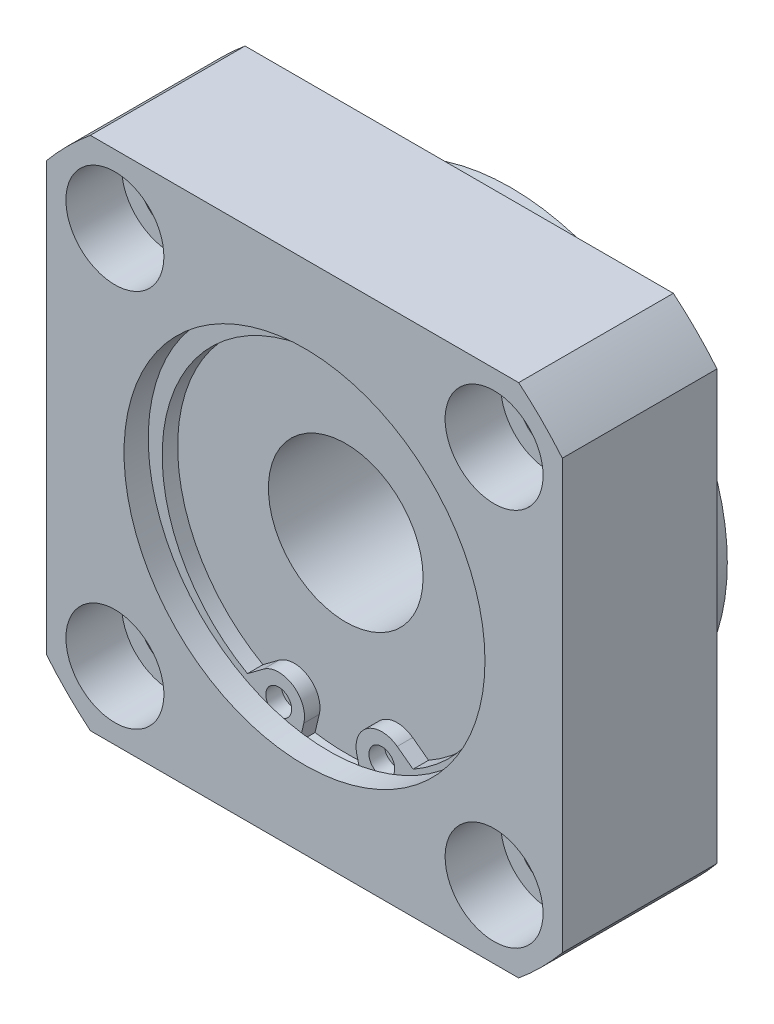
ISO-10303-21;
HEADER;
FILE_DESCRIPTION(('STEP AP214'),'2;1');
FILE_NAME('part.step','',(''),(''),'','','');
FILE_SCHEMA(('AUTOMOTIVE_DESIGN { 1 0 10303 214 1 1 1 1 }'));
ENDSEC;
DATA;
#1=APPLICATION_CONTEXT('core data for automotive mechanical design processes');
#2=APPLICATION_PROTOCOL_DEFINITION('international standard','automotive_design',2000,#1);
#3=PRODUCT_CONTEXT('',#1,'mechanical');
#4=PRODUCT('Part','Part','',(#3));
#5=PRODUCT_RELATED_PRODUCT_CATEGORY('part','',(#4));
#6=PRODUCT_DEFINITION_FORMATION('','',#4);
#7=PRODUCT_DEFINITION_CONTEXT('part definition',#1,'design');
#8=PRODUCT_DEFINITION('design','',#6,#7);
#9=PRODUCT_DEFINITION_SHAPE('','',#8);
#10=(LENGTH_UNIT() NAMED_UNIT(*) SI_UNIT(.MILLI.,.METRE.));
#11=(NAMED_UNIT(*) PLANE_ANGLE_UNIT() SI_UNIT($,.RADIAN.));
#12=(NAMED_UNIT(*) SI_UNIT($,.STERADIAN.) SOLID_ANGLE_UNIT());
#13=UNCERTAINTY_MEASURE_WITH_UNIT(LENGTH_MEASURE(1.E-05),#10,'distance_accuracy_value','');
#14=(GEOMETRIC_REPRESENTATION_CONTEXT(3) GLOBAL_UNCERTAINTY_ASSIGNED_CONTEXT((#13)) GLOBAL_UNIT_ASSIGNED_CONTEXT((#10,
#11,#12)) REPRESENTATION_CONTEXT('',''));
#15=CARTESIAN_POINT('',(0.,0.,0.));
#16=DIRECTION('',(0.,0.,1.));
#17=DIRECTION('',(1.,0.,0.));
#18=AXIS2_PLACEMENT_3D('',#15,#16,#17);
#19=CARTESIAN_POINT('',(18.3847763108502,18.3847763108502,0.));
#20=DIRECTION('',(0.,0.,1.));
#21=DIRECTION('',(1.,0.,0.));
#22=AXIS2_PLACEMENT_3D('',#19,#20,#21);
#23=CYLINDRICAL_SURFACE('',#22,3.);
#24=CARTESIAN_POINT('',(18.3847763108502,18.3847763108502,0.));
#25=DIRECTION('',(0.,0.,1.));
#26=DIRECTION('',(1.,0.,0.));
#27=AXIS2_PLACEMENT_3D('',#24,#25,#26);
#28=CIRCLE('',#27,3.);
#29=CARTESIAN_POINT('',(21.3847763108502,18.3847763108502,0.));
#30=VERTEX_POINT('',#29);
#31=EDGE_CURVE('E268',#30,#30,#28,.T.);
#32=ORIENTED_EDGE('',*,*,#31,.F.);
#33=EDGE_LOOP('',(#32));
#34=FACE_BOUND('',#33,.T.);
#35=CARTESIAN_POINT('',(18.3847763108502,18.3847763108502,9.6));
#36=DIRECTION('',(0.,0.,1.));
#37=DIRECTION('',(1.,0.,0.));
#38=AXIS2_PLACEMENT_3D('',#35,#36,#37);
#39=CIRCLE('',#38,3.);
#40=CARTESIAN_POINT('',(21.3847763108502,18.3847763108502,9.6));
#41=VERTEX_POINT('',#40);
#42=EDGE_CURVE('E265',#41,#41,#39,.F.);
#43=ORIENTED_EDGE('',*,*,#42,.F.);
#44=EDGE_LOOP('',(#43));
#45=FACE_BOUND('',#44,.T.);
#46=ADVANCED_FACE('F14',(#34,#45),#23,.F.);
#47=CARTESIAN_POINT('',(18.3847763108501,-18.3847763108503,0.));
#48=DIRECTION('',(0.,0.,1.));
#49=DIRECTION('',(1.,0.,0.));
#50=AXIS2_PLACEMENT_3D('',#47,#48,#49);
#51=CYLINDRICAL_SURFACE('',#50,3.);
#52=CARTESIAN_POINT('',(18.3847763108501,-18.3847763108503,0.));
#53=DIRECTION('',(0.,0.,1.));
#54=DIRECTION('',(0.,-1.,0.));
#55=AXIS2_PLACEMENT_3D('',#52,#53,#54);
#56=CIRCLE('',#55,3.);
#57=CARTESIAN_POINT('',(18.3847763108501,-21.3847763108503,0.));
#58=VERTEX_POINT('',#57);
#59=EDGE_CURVE('E341',#58,#58,#56,.T.);
#60=ORIENTED_EDGE('',*,*,#59,.F.);
#61=EDGE_LOOP('',(#60));
#62=FACE_BOUND('',#61,.T.);
#63=CARTESIAN_POINT('',(18.3847763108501,-18.3847763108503,9.6));
#64=DIRECTION('',(0.,0.,1.));
#65=DIRECTION('',(1.,0.,0.));
#66=AXIS2_PLACEMENT_3D('',#63,#64,#65);
#67=CIRCLE('',#66,3.);
#68=CARTESIAN_POINT('',(21.3847763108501,-18.3847763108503,9.6));
#69=VERTEX_POINT('',#68);
#70=EDGE_CURVE('E260',#69,#69,#67,.F.);
#71=ORIENTED_EDGE('',*,*,#70,.F.);
#72=EDGE_LOOP('',(#71));
#73=FACE_BOUND('',#72,.T.);
#74=ADVANCED_FACE('F535',(#62,#73),#51,.F.);
#75=CARTESIAN_POINT('',(-18.3847763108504,-18.3847763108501,0.));
#76=DIRECTION('',(0.,0.,1.));
#77=DIRECTION('',(1.,0.,0.));
#78=AXIS2_PLACEMENT_3D('',#75,#76,#77);
#79=CYLINDRICAL_SURFACE('',#78,3.);
#80=CARTESIAN_POINT('',(-18.3847763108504,-18.3847763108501,0.));
#81=DIRECTION('',(0.,0.,1.));
#82=DIRECTION('',(-1.,0.,0.));
#83=AXIS2_PLACEMENT_3D('',#80,#81,#82);
#84=CIRCLE('',#83,3.);
#85=CARTESIAN_POINT('',(-21.3847763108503,-18.3847763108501,0.));
#86=VERTEX_POINT('',#85);
#87=EDGE_CURVE('E344',#86,#86,#84,.T.);
#88=ORIENTED_EDGE('',*,*,#87,.F.);
#89=EDGE_LOOP('',(#88));
#90=FACE_BOUND('',#89,.T.);
#91=CARTESIAN_POINT('',(-18.3847763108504,-18.3847763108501,9.6));
#92=DIRECTION('',(0.,0.,1.));
#93=DIRECTION('',(1.,0.,0.));
#94=AXIS2_PLACEMENT_3D('',#91,#92,#93);
#95=CIRCLE('',#94,3.);
#96=CARTESIAN_POINT('',(-15.3847763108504,-18.3847763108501,9.6));
#97=VERTEX_POINT('',#96);
#98=EDGE_CURVE('E255',#97,#97,#95,.F.);
#99=ORIENTED_EDGE('',*,*,#98,.F.);
#100=EDGE_LOOP('',(#99));
#101=FACE_BOUND('',#100,.T.);
#102=ADVANCED_FACE('F544',(#90,#101),#79,.F.);
#103=CARTESIAN_POINT('',(-18.3847763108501,18.3847763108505,0.));
#104=DIRECTION('',(0.,0.,1.));
#105=DIRECTION('',(1.,0.,0.));
#106=AXIS2_PLACEMENT_3D('',#103,#104,#105);
#107=CYLINDRICAL_SURFACE('',#106,3.);
#108=CARTESIAN_POINT('',(-18.3847763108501,18.3847763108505,0.));
#109=DIRECTION('',(0.,0.,1.));
#110=DIRECTION('',(0.,1.,0.));
#111=AXIS2_PLACEMENT_3D('',#108,#109,#110);
#112=CIRCLE('',#111,3.);
#113=CARTESIAN_POINT('',(-18.38477631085,21.3847763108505,0.));
#114=VERTEX_POINT('',#113);
#115=EDGE_CURVE('E263',#114,#114,#112,.T.);
#116=ORIENTED_EDGE('',*,*,#115,.F.);
#117=EDGE_LOOP('',(#116));
#118=FACE_BOUND('',#117,.T.);
#119=CARTESIAN_POINT('',(-18.3847763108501,18.3847763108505,9.6));
#120=DIRECTION('',(0.,0.,1.));
#121=DIRECTION('',(1.,0.,0.));
#122=AXIS2_PLACEMENT_3D('',#119,#120,#121);
#123=CIRCLE('',#122,3.);
#124=CARTESIAN_POINT('',(-15.3847763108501,18.3847763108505,9.6));
#125=VERTEX_POINT('',#124);
#126=EDGE_CURVE('E250',#125,#125,#123,.F.);
#127=ORIENTED_EDGE('',*,*,#126,.F.);
#128=EDGE_LOOP('',(#127));
#129=FACE_BOUND('',#128,.T.);
#130=ADVANCED_FACE('F553',(#118,#129),#107,.F.);
#131=CARTESIAN_POINT('',(0.,0.,-5.));
#132=DIRECTION('',(0.,0.,1.));
#133=DIRECTION('',(1.,0.,0.));
#134=AXIS2_PLACEMENT_3D('',#131,#132,#133);
#135=CYLINDRICAL_SURFACE('',#134,21.);
#136=CARTESIAN_POINT('',(0.,0.,-5.));
#137=DIRECTION('',(0.,0.,-1.));
#138=DIRECTION('',(-1.,0.,0.));
#139=AXIS2_PLACEMENT_3D('',#136,#137,#138);
#140=CIRCLE('',#139,21.);
#141=CARTESIAN_POINT('',(-21.,0.,-5.));
#142=VERTEX_POINT('',#141);
#143=EDGE_CURVE('E363',#142,#142,#140,.T.);
#144=ORIENTED_EDGE('',*,*,#143,.F.);
#145=EDGE_LOOP('',(#144));
#146=FACE_BOUND('',#145,.T.);
#147=CARTESIAN_POINT('',(0.,0.,0.));
#148=DIRECTION('',(0.,0.,-1.));
#149=DIRECTION('',(-1.,0.,0.));
#150=AXIS2_PLACEMENT_3D('',#147,#148,#149);
#151=CIRCLE('',#150,21.);
#152=CARTESIAN_POINT('',(-21.,0.,0.));
#153=VERTEX_POINT('',#152);
#154=EDGE_CURVE('E239',#153,#153,#151,.T.);
#155=ORIENTED_EDGE('',*,*,#154,.T.);
#156=EDGE_LOOP('',(#155));
#157=FACE_BOUND('',#156,.T.);
#158=ADVANCED_FACE('F562',(#146,#157),#135,.T.);
#159=CARTESIAN_POINT('',(0.,0.,0.));
#160=DIRECTION('',(0.,0.,-1.));
#161=DIRECTION('',(-1.,0.,0.));
#162=AXIS2_PLACEMENT_3D('',#159,#160,#161);
#163=PLANE('',#162);
#164=ORIENTED_EDGE('',*,*,#154,.F.);
#165=EDGE_LOOP('',(#164));
#166=FACE_BOUND('',#165,.T.);
#167=ORIENTED_EDGE('',*,*,#115,.T.);
#168=EDGE_LOOP('',(#167));
#169=FACE_BOUND('',#168,.T.);
#170=ORIENTED_EDGE('',*,*,#87,.T.);
#171=EDGE_LOOP('',(#170));
#172=FACE_BOUND('',#171,.T.);
#173=ORIENTED_EDGE('',*,*,#59,.T.);
#174=EDGE_LOOP('',(#173));
#175=FACE_BOUND('',#174,.T.);
#176=ORIENTED_EDGE('',*,*,#31,.T.);
#177=EDGE_LOOP('',(#176));
#178=FACE_BOUND('',#177,.T.);
#179=CARTESIAN_POINT('',(0.,0.,0.));
#180=DIRECTION('',(0.,0.,-1.));
#181=DIRECTION('',(-1.,0.,0.));
#182=AXIS2_PLACEMENT_3D('',#179,#180,#181);
#183=CIRCLE('',#182,32.5);
#184=CARTESIAN_POINT('',(25.,-20.7665596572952,0.));
#185=VERTEX_POINT('',#184);
#186=CARTESIAN_POINT('',(20.7665596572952,-25.,0.));
#187=VERTEX_POINT('',#186);
#188=EDGE_CURVE('E329',#185,#187,#183,.T.);
#189=ORIENTED_EDGE('',*,*,#188,.T.);
#190=DIRECTION('',(1.,0.,0.));
#191=VECTOR('',#190,1.);
#192=CARTESIAN_POINT('',(-20.7665596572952,-25.,0.));
#193=LINE('',#192,#191);
#194=CARTESIAN_POINT('',(-20.7665596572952,-25.,0.));
#195=VERTEX_POINT('',#194);
#196=EDGE_CURVE('E326',#195,#187,#193,.T.);
#197=ORIENTED_EDGE('',*,*,#196,.F.);
#198=CARTESIAN_POINT('',(0.,0.,0.));
#199=DIRECTION('',(0.,0.,1.));
#200=DIRECTION('',(1.,0.,0.));
#201=AXIS2_PLACEMENT_3D('',#198,#199,#200);
#202=CIRCLE('',#201,32.5);
#203=CARTESIAN_POINT('',(-25.,-20.7665596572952,0.));
#204=VERTEX_POINT('',#203);
#205=EDGE_CURVE('E323',#204,#195,#202,.T.);
#206=ORIENTED_EDGE('',*,*,#205,.F.);
#207=DIRECTION('',(0.,-1.,0.));
#208=VECTOR('',#207,1.);
#209=CARTESIAN_POINT('',(-25.,20.7665596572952,0.));
#210=LINE('',#209,#208);
#211=CARTESIAN_POINT('',(-25.,20.7665596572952,0.));
#212=VERTEX_POINT('',#211);
#213=EDGE_CURVE('E320',#212,#204,#210,.T.);
#214=ORIENTED_EDGE('',*,*,#213,.F.);
#215=CARTESIAN_POINT('',(0.,0.,0.));
#216=DIRECTION('',(0.,0.,-1.));
#217=DIRECTION('',(-1.,0.,0.));
#218=AXIS2_PLACEMENT_3D('',#215,#216,#217);
#219=CIRCLE('',#218,32.5);
#220=CARTESIAN_POINT('',(-20.7665596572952,25.,0.));
#221=VERTEX_POINT('',#220);
#222=EDGE_CURVE('E317',#212,#221,#219,.T.);
#223=ORIENTED_EDGE('',*,*,#222,.T.);
#224=DIRECTION('',(1.,0.,0.));
#225=VECTOR('',#224,1.);
#226=CARTESIAN_POINT('',(-20.7665596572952,25.,0.));
#227=LINE('',#226,#225);
#228=CARTESIAN_POINT('',(20.7665596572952,25.,0.));
#229=VERTEX_POINT('',#228);
#230=EDGE_CURVE('E314',#221,#229,#227,.T.);
#231=ORIENTED_EDGE('',*,*,#230,.T.);
#232=CARTESIAN_POINT('',(0.,0.,0.));
#233=DIRECTION('',(0.,0.,1.));
#234=DIRECTION('',(1.,0.,0.));
#235=AXIS2_PLACEMENT_3D('',#232,#233,#234);
#236=CIRCLE('',#235,32.5);
#237=CARTESIAN_POINT('',(25.,20.7665596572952,0.));
#238=VERTEX_POINT('',#237);
#239=EDGE_CURVE('E311',#238,#229,#236,.T.);
#240=ORIENTED_EDGE('',*,*,#239,.F.);
#241=DIRECTION('',(0.,-1.,0.));
#242=VECTOR('',#241,1.);
#243=CARTESIAN_POINT('',(25.,20.7665596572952,0.));
#244=LINE('',#243,#242);
#245=EDGE_CURVE('E308',#238,#185,#244,.T.);
#246=ORIENTED_EDGE('',*,*,#245,.T.);
#247=EDGE_LOOP('',(#189,#197,#206,#214,#223,#231,#240,#246));
#248=FACE_BOUND('',#247,.T.);
#249=ADVANCED_FACE('F437',(#166,#169,#172,#175,#178,#248),#163,.T.);
#250=CARTESIAN_POINT('',(18.3847763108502,18.3847763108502,9.6));
#251=DIRECTION('',(0.,0.,1.));
#252=DIRECTION('',(1.,0.,0.));
#253=AXIS2_PLACEMENT_3D('',#250,#251,#252);
#254=PLANE('',#253);
#255=CARTESIAN_POINT('',(18.3847763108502,18.3847763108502,9.6));
#256=DIRECTION('',(0.,0.,1.));
#257=DIRECTION('',(1.,0.,0.));
#258=AXIS2_PLACEMENT_3D('',#255,#256,#257);
#259=CIRCLE('',#258,4.75);
#260=CARTESIAN_POINT('',(23.1347763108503,18.3847763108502,9.6));
#261=VERTEX_POINT('',#260);
#262=EDGE_CURVE('E269',#261,#261,#259,.T.);
#263=ORIENTED_EDGE('',*,*,#262,.T.);
#264=EDGE_LOOP('',(#263));
#265=FACE_BOUND('',#264,.T.);
#266=ORIENTED_EDGE('',*,*,#42,.T.);
#267=EDGE_LOOP('',(#266));
#268=FACE_BOUND('',#267,.T.);
#269=ADVANCED_FACE('F579',(#265,#268),#254,.T.);
#270=CARTESIAN_POINT('',(18.3847763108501,-18.3847763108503,9.6));
#271=DIRECTION('',(0.,0.,1.));
#272=DIRECTION('',(0.,-1.,0.));
#273=AXIS2_PLACEMENT_3D('',#270,#271,#272);
#274=PLANE('',#273);
#275=CARTESIAN_POINT('',(18.3847763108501,-18.3847763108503,9.6));
#276=DIRECTION('',(0.,0.,1.));
#277=DIRECTION('',(0.,-1.,0.));
#278=AXIS2_PLACEMENT_3D('',#275,#276,#277);
#279=CIRCLE('',#278,4.75);
#280=CARTESIAN_POINT('',(18.3847763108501,-23.1347763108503,9.6));
#281=VERTEX_POINT('',#280);
#282=EDGE_CURVE('E264',#281,#281,#279,.T.);
#283=ORIENTED_EDGE('',*,*,#282,.T.);
#284=EDGE_LOOP('',(#283));
#285=FACE_BOUND('',#284,.T.);
#286=ORIENTED_EDGE('',*,*,#70,.T.);
#287=EDGE_LOOP('',(#286));
#288=FACE_BOUND('',#287,.T.);
#289=ADVANCED_FACE('F588',(#285,#288),#274,.T.);
#290=CARTESIAN_POINT('',(-18.3847763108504,-18.3847763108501,9.6));
#291=DIRECTION('',(0.,0.,1.));
#292=DIRECTION('',(-1.,0.,0.));
#293=AXIS2_PLACEMENT_3D('',#290,#291,#292);
#294=PLANE('',#293);
#295=CARTESIAN_POINT('',(-18.3847763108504,-18.3847763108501,9.6));
#296=DIRECTION('',(0.,0.,1.));
#297=DIRECTION('',(-1.,0.,0.));
#298=AXIS2_PLACEMENT_3D('',#295,#296,#297);
#299=CIRCLE('',#298,4.75);
#300=CARTESIAN_POINT('',(-23.1347763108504,-18.3847763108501,9.6));
#301=VERTEX_POINT('',#300);
#302=EDGE_CURVE('E259',#301,#301,#299,.T.);
#303=ORIENTED_EDGE('',*,*,#302,.T.);
#304=EDGE_LOOP('',(#303));
#305=FACE_BOUND('',#304,.T.);
#306=ORIENTED_EDGE('',*,*,#98,.T.);
#307=EDGE_LOOP('',(#306));
#308=FACE_BOUND('',#307,.T.);
#309=ADVANCED_FACE('F597',(#305,#308),#294,.T.);
#310=CARTESIAN_POINT('',(-18.3847763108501,18.3847763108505,9.6));
#311=DIRECTION('',(0.,0.,1.));
#312=DIRECTION('',(0.,1.,0.));
#313=AXIS2_PLACEMENT_3D('',#310,#311,#312);
#314=PLANE('',#313);
#315=CARTESIAN_POINT('',(-18.3847763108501,18.3847763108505,9.6));
#316=DIRECTION('',(0.,0.,1.));
#317=DIRECTION('',(0.,1.,0.));
#318=AXIS2_PLACEMENT_3D('',#315,#316,#317);
#319=CIRCLE('',#318,4.75);
#320=CARTESIAN_POINT('',(-18.38477631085,23.1347763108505,9.6));
#321=VERTEX_POINT('',#320);
#322=EDGE_CURVE('E254',#321,#321,#319,.T.);
#323=ORIENTED_EDGE('',*,*,#322,.T.);
#324=EDGE_LOOP('',(#323));
#325=FACE_BOUND('',#324,.T.);
#326=ORIENTED_EDGE('',*,*,#126,.T.);
#327=EDGE_LOOP('',(#326));
#328=FACE_BOUND('',#327,.T.);
#329=ADVANCED_FACE('F606',(#325,#328),#314,.T.);
#330=CARTESIAN_POINT('',(0.,0.,-5.));
#331=DIRECTION('',(0.,0.,-1.));
#332=DIRECTION('',(-1.,0.,0.));
#333=AXIS2_PLACEMENT_3D('',#330,#331,#332);
#334=PLANE('',#333);
#335=ORIENTED_EDGE('',*,*,#143,.T.);
#336=EDGE_LOOP('',(#335));
#337=FACE_BOUND('',#336,.T.);
#338=CARTESIAN_POINT('',(0.,0.,-5.));
#339=DIRECTION('',(0.,0.,-1.));
#340=DIRECTION('',(-1.,0.,0.));
#341=AXIS2_PLACEMENT_3D('',#338,#339,#340);
#342=CIRCLE('',#341,14.5);
#343=CARTESIAN_POINT('',(-14.5,0.,-5.));
#344=VERTEX_POINT('',#343);
#345=EDGE_CURVE('E366',#344,#344,#342,.T.);
#346=ORIENTED_EDGE('',*,*,#345,.F.);
#347=EDGE_LOOP('',(#346));
#348=FACE_BOUND('',#347,.T.);
#349=ADVANCED_FACE('F615',(#337,#348),#334,.T.);
#350=CARTESIAN_POINT('',(-20.7665596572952,-25.,15.));
#351=DIRECTION('',(0.,1.,0.));
#352=DIRECTION('',(0.,0.,1.));
#353=AXIS2_PLACEMENT_3D('',#350,#351,#352);
#354=PLANE('',#353);
#355=DIRECTION('',(1.,0.,0.));
#356=VECTOR('',#355,1.);
#357=CARTESIAN_POINT('',(-20.7665596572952,-25.,15.));
#358=LINE('',#357,#356);
#359=CARTESIAN_POINT('',(-20.7665596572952,-25.,15.));
#360=VERTEX_POINT('',#359);
#361=CARTESIAN_POINT('',(20.7665596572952,-25.,15.));
#362=VERTEX_POINT('',#361);
#363=EDGE_CURVE('E303',#360,#362,#358,.T.);
#364=ORIENTED_EDGE('',*,*,#363,.F.);
#365=DIRECTION('',(0.,0.,-1.));
#366=VECTOR('',#365,1.);
#367=CARTESIAN_POINT('',(-20.7665596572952,-25.,15.));
#368=LINE('',#367,#366);
#369=EDGE_CURVE('E282',#360,#195,#368,.T.);
#370=ORIENTED_EDGE('',*,*,#369,.T.);
#371=ORIENTED_EDGE('',*,*,#196,.T.);
#372=DIRECTION('',(0.,0.,-1.));
#373=VECTOR('',#372,1.);
#374=CARTESIAN_POINT('',(20.7665596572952,-25.,15.));
#375=LINE('',#374,#373);
#376=EDGE_CURVE('E74',#362,#187,#375,.T.);
#377=ORIENTED_EDGE('',*,*,#376,.F.);
#378=EDGE_LOOP('',(#364,#370,#371,#377));
#379=FACE_BOUND('',#378,.T.);
#380=ADVANCED_FACE('F435',(#379),#354,.F.);
#381=CARTESIAN_POINT('',(0.,0.,15.));
#382=DIRECTION('',(0.,0.,-1.));
#383=DIRECTION('',(-1.,0.,0.));
#384=AXIS2_PLACEMENT_3D('',#381,#382,#383);
#385=CYLINDRICAL_SURFACE('',#384,32.5);
#386=ORIENTED_EDGE('',*,*,#369,.F.);
#387=CARTESIAN_POINT('',(0.,0.,15.));
#388=DIRECTION('',(0.,0.,1.));
#389=DIRECTION('',(1.,0.,0.));
#390=AXIS2_PLACEMENT_3D('',#387,#388,#389);
#391=CIRCLE('',#390,32.5);
#392=CARTESIAN_POINT('',(-25.,-20.7665596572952,15.));
#393=VERTEX_POINT('',#392);
#394=EDGE_CURVE('E300',#393,#360,#391,.T.);
#395=ORIENTED_EDGE('',*,*,#394,.F.);
#396=DIRECTION('',(0.,0.,-1.));
#397=VECTOR('',#396,1.);
#398=CARTESIAN_POINT('',(-25.,-20.7665596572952,15.));
#399=LINE('',#398,#397);
#400=EDGE_CURVE('E280',#393,#204,#399,.T.);
#401=ORIENTED_EDGE('',*,*,#400,.T.);
#402=ORIENTED_EDGE('',*,*,#205,.T.);
#403=EDGE_LOOP('',(#386,#395,#401,#402));
#404=FACE_BOUND('',#403,.T.);
#405=ADVANCED_FACE('F431',(#404),#385,.T.);
#406=CARTESIAN_POINT('',(-25.,20.7665596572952,15.));
#407=DIRECTION('',(1.,0.,0.));
#408=DIRECTION('',(0.,0.,-1.));
#409=AXIS2_PLACEMENT_3D('',#406,#407,#408);
#410=PLANE('',#409);
#411=ORIENTED_EDGE('',*,*,#400,.F.);
#412=DIRECTION('',(0.,-1.,0.));
#413=VECTOR('',#412,1.);
#414=CARTESIAN_POINT('',(-25.,20.7665596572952,15.));
#415=LINE('',#414,#413);
#416=CARTESIAN_POINT('',(-25.,20.7665596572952,15.));
#417=VERTEX_POINT('',#416);
#418=EDGE_CURVE('E297',#417,#393,#415,.T.);
#419=ORIENTED_EDGE('',*,*,#418,.F.);
#420=DIRECTION('',(0.,0.,-1.));
#421=VECTOR('',#420,1.);
#422=CARTESIAN_POINT('',(-25.,20.7665596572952,15.));
#423=LINE('',#422,#421);
#424=EDGE_CURVE('E278',#417,#212,#423,.T.);
#425=ORIENTED_EDGE('',*,*,#424,.T.);
#426=ORIENTED_EDGE('',*,*,#213,.T.);
#427=EDGE_LOOP('',(#411,#419,#425,#426));
#428=FACE_BOUND('',#427,.T.);
#429=ADVANCED_FACE('F428',(#428),#410,.F.);
#430=CARTESIAN_POINT('',(0.,0.,15.));
#431=DIRECTION('',(0.,0.,-1.));
#432=DIRECTION('',(-1.,0.,0.));
#433=AXIS2_PLACEMENT_3D('',#430,#431,#432);
#434=CYLINDRICAL_SURFACE('',#433,32.5);
#435=ORIENTED_EDGE('',*,*,#424,.F.);
#436=CARTESIAN_POINT('',(0.,0.,15.));
#437=DIRECTION('',(0.,0.,-1.));
#438=DIRECTION('',(-1.,0.,0.));
#439=AXIS2_PLACEMENT_3D('',#436,#437,#438);
#440=CIRCLE('',#439,32.5);
#441=CARTESIAN_POINT('',(-20.7665596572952,25.,15.));
#442=VERTEX_POINT('',#441);
#443=EDGE_CURVE('E294',#417,#442,#440,.T.);
#444=ORIENTED_EDGE('',*,*,#443,.T.);
#445=DIRECTION('',(0.,0.,-1.));
#446=VECTOR('',#445,1.);
#447=CARTESIAN_POINT('',(-20.7665596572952,25.,15.));
#448=LINE('',#447,#446);
#449=EDGE_CURVE('E276',#442,#221,#448,.T.);
#450=ORIENTED_EDGE('',*,*,#449,.T.);
#451=ORIENTED_EDGE('',*,*,#222,.F.);
#452=EDGE_LOOP('',(#435,#444,#450,#451));
#453=FACE_BOUND('',#452,.T.);
#454=ADVANCED_FACE('F424',(#453),#434,.T.);
#455=CARTESIAN_POINT('',(-20.7665596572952,25.,15.));
#456=DIRECTION('',(0.,1.,0.));
#457=DIRECTION('',(0.,0.,1.));
#458=AXIS2_PLACEMENT_3D('',#455,#456,#457);
#459=PLANE('',#458);
#460=ORIENTED_EDGE('',*,*,#449,.F.);
#461=DIRECTION('',(1.,0.,0.));
#462=VECTOR('',#461,1.);
#463=CARTESIAN_POINT('',(-20.7665596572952,25.,15.));
#464=LINE('',#463,#462);
#465=CARTESIAN_POINT('',(20.7665596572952,25.,15.));
#466=VERTEX_POINT('',#465);
#467=EDGE_CURVE('E291',#442,#466,#464,.T.);
#468=ORIENTED_EDGE('',*,*,#467,.T.);
#469=DIRECTION('',(0.,0.,-1.));
#470=VECTOR('',#469,1.);
#471=CARTESIAN_POINT('',(20.7665596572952,25.,15.));
#472=LINE('',#471,#470);
#473=EDGE_CURVE('E274',#466,#229,#472,.T.);
#474=ORIENTED_EDGE('',*,*,#473,.T.);
#475=ORIENTED_EDGE('',*,*,#230,.F.);
#476=EDGE_LOOP('',(#460,#468,#474,#475));
#477=FACE_BOUND('',#476,.T.);
#478=ADVANCED_FACE('F420',(#477),#459,.T.);
#479=CARTESIAN_POINT('',(0.,0.,15.));
#480=DIRECTION('',(0.,0.,-1.));
#481=DIRECTION('',(-1.,0.,0.));
#482=AXIS2_PLACEMENT_3D('',#479,#480,#481);
#483=CYLINDRICAL_SURFACE('',#482,32.5);
#484=ORIENTED_EDGE('',*,*,#473,.F.);
#485=CARTESIAN_POINT('',(0.,0.,15.));
#486=DIRECTION('',(0.,0.,1.));
#487=DIRECTION('',(1.,0.,0.));
#488=AXIS2_PLACEMENT_3D('',#485,#486,#487);
#489=CIRCLE('',#488,32.5);
#490=CARTESIAN_POINT('',(25.,20.7665596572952,15.));
#491=VERTEX_POINT('',#490);
#492=EDGE_CURVE('E288',#491,#466,#489,.T.);
#493=ORIENTED_EDGE('',*,*,#492,.F.);
#494=DIRECTION('',(0.,0.,-1.));
#495=VECTOR('',#494,1.);
#496=CARTESIAN_POINT('',(25.,20.7665596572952,15.));
#497=LINE('',#496,#495);
#498=EDGE_CURVE('E272',#491,#238,#497,.T.);
#499=ORIENTED_EDGE('',*,*,#498,.T.);
#500=ORIENTED_EDGE('',*,*,#239,.T.);
#501=EDGE_LOOP('',(#484,#493,#499,#500));
#502=FACE_BOUND('',#501,.T.);
#503=ADVANCED_FACE('F416',(#502),#483,.T.);
#504=CARTESIAN_POINT('',(25.,20.7665596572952,15.));
#505=DIRECTION('',(1.,0.,0.));
#506=DIRECTION('',(0.,0.,-1.));
#507=AXIS2_PLACEMENT_3D('',#504,#505,#506);
#508=PLANE('',#507);
#509=ORIENTED_EDGE('',*,*,#498,.F.);
#510=DIRECTION('',(0.,-1.,0.));
#511=VECTOR('',#510,1.);
#512=CARTESIAN_POINT('',(25.,20.7665596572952,15.));
#513=LINE('',#512,#511);
#514=CARTESIAN_POINT('',(25.,-20.7665596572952,15.));
#515=VERTEX_POINT('',#514);
#516=EDGE_CURVE('E285',#491,#515,#513,.T.);
#517=ORIENTED_EDGE('',*,*,#516,.T.);
#518=DIRECTION('',(0.,0.,-1.));
#519=VECTOR('',#518,1.);
#520=CARTESIAN_POINT('',(25.,-20.7665596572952,15.));
#521=LINE('',#520,#519);
#522=EDGE_CURVE('E270',#515,#185,#521,.T.);
#523=ORIENTED_EDGE('',*,*,#522,.T.);
#524=ORIENTED_EDGE('',*,*,#245,.F.);
#525=EDGE_LOOP('',(#509,#517,#523,#524));
#526=FACE_BOUND('',#525,.T.);
#527=ADVANCED_FACE('F411',(#526),#508,.T.);
#528=CARTESIAN_POINT('',(0.,0.,15.));
#529=DIRECTION('',(0.,0.,-1.));
#530=DIRECTION('',(-1.,0.,0.));
#531=AXIS2_PLACEMENT_3D('',#528,#529,#530);
#532=CYLINDRICAL_SURFACE('',#531,32.5);
#533=ORIENTED_EDGE('',*,*,#522,.F.);
#534=CARTESIAN_POINT('',(0.,0.,15.));
#535=DIRECTION('',(0.,0.,-1.));
#536=DIRECTION('',(-1.,0.,0.));
#537=AXIS2_PLACEMENT_3D('',#534,#535,#536);
#538=CIRCLE('',#537,32.5);
#539=EDGE_CURVE('E306',#515,#362,#538,.T.);
#540=ORIENTED_EDGE('',*,*,#539,.T.);
#541=ORIENTED_EDGE('',*,*,#376,.T.);
#542=ORIENTED_EDGE('',*,*,#188,.F.);
#543=EDGE_LOOP('',(#533,#540,#541,#542));
#544=FACE_BOUND('',#543,.T.);
#545=ADVANCED_FACE('F438',(#544),#532,.T.);
#546=CARTESIAN_POINT('',(18.3847763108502,18.3847763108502,9.6));
#547=DIRECTION('',(0.,0.,1.));
#548=DIRECTION('',(1.,0.,0.));
#549=AXIS2_PLACEMENT_3D('',#546,#547,#548);
#550=CYLINDRICAL_SURFACE('',#549,4.75);
#551=ORIENTED_EDGE('',*,*,#262,.F.);
#552=EDGE_LOOP('',(#551));
#553=FACE_BOUND('',#552,.T.);
#554=CARTESIAN_POINT('',(18.3847763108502,18.3847763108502,15.));
#555=DIRECTION('',(0.,0.,1.));
#556=DIRECTION('',(1.,0.,0.));
#557=AXIS2_PLACEMENT_3D('',#554,#555,#556);
#558=CIRCLE('',#557,4.75);
#559=CARTESIAN_POINT('',(23.1347763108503,18.3847763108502,15.));
#560=VERTEX_POINT('',#559);
#561=EDGE_CURVE('E338',#560,#560,#558,.T.);
#562=ORIENTED_EDGE('',*,*,#561,.T.);
#563=EDGE_LOOP('',(#562));
#564=FACE_BOUND('',#563,.T.);
#565=ADVANCED_FACE('F440',(#553,#564),#550,.F.);
#566=CARTESIAN_POINT('',(18.3847763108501,-18.3847763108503,9.6));
#567=DIRECTION('',(0.,0.,1.));
#568=DIRECTION('',(1.,0.,0.));
#569=AXIS2_PLACEMENT_3D('',#566,#567,#568);
#570=CYLINDRICAL_SURFACE('',#569,4.75);
#571=ORIENTED_EDGE('',*,*,#282,.F.);
#572=EDGE_LOOP('',(#571));
#573=FACE_BOUND('',#572,.T.);
#574=CARTESIAN_POINT('',(18.3847763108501,-18.3847763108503,15.));
#575=DIRECTION('',(0.,0.,1.));
#576=DIRECTION('',(0.,-1.,0.));
#577=AXIS2_PLACEMENT_3D('',#574,#575,#576);
#578=CIRCLE('',#577,4.75);
#579=CARTESIAN_POINT('',(18.3847763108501,-23.1347763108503,15.));
#580=VERTEX_POINT('',#579);
#581=EDGE_CURVE('E258',#580,#580,#578,.T.);
#582=ORIENTED_EDGE('',*,*,#581,.T.);
#583=EDGE_LOOP('',(#582));
#584=FACE_BOUND('',#583,.T.);
#585=ADVANCED_FACE('F447',(#573,#584),#570,.F.);
#586=CARTESIAN_POINT('',(-18.3847763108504,-18.3847763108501,9.6));
#587=DIRECTION('',(0.,0.,1.));
#588=DIRECTION('',(1.,0.,0.));
#589=AXIS2_PLACEMENT_3D('',#586,#587,#588);
#590=CYLINDRICAL_SURFACE('',#589,4.75);
#591=ORIENTED_EDGE('',*,*,#302,.F.);
#592=EDGE_LOOP('',(#591));
#593=FACE_BOUND('',#592,.T.);
#594=CARTESIAN_POINT('',(-18.3847763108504,-18.3847763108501,15.));
#595=DIRECTION('',(0.,0.,1.));
#596=DIRECTION('',(-1.,0.,0.));
#597=AXIS2_PLACEMENT_3D('',#594,#595,#596);
#598=CIRCLE('',#597,4.75);
#599=CARTESIAN_POINT('',(-23.1347763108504,-18.3847763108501,15.));
#600=VERTEX_POINT('',#599);
#601=EDGE_CURVE('E253',#600,#600,#598,.T.);
#602=ORIENTED_EDGE('',*,*,#601,.T.);
#603=EDGE_LOOP('',(#602));
#604=FACE_BOUND('',#603,.T.);
#605=ADVANCED_FACE('F674',(#593,#604),#590,.F.);
#606=CARTESIAN_POINT('',(-18.3847763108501,18.3847763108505,9.6));
#607=DIRECTION('',(0.,0.,1.));
#608=DIRECTION('',(1.,0.,0.));
#609=AXIS2_PLACEMENT_3D('',#606,#607,#608);
#610=CYLINDRICAL_SURFACE('',#609,4.75);
#611=ORIENTED_EDGE('',*,*,#322,.F.);
#612=EDGE_LOOP('',(#611));
#613=FACE_BOUND('',#612,.T.);
#614=CARTESIAN_POINT('',(-18.3847763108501,18.3847763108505,15.));
#615=DIRECTION('',(0.,0.,1.));
#616=DIRECTION('',(0.,1.,0.));
#617=AXIS2_PLACEMENT_3D('',#614,#615,#616);
#618=CIRCLE('',#617,4.75);
#619=CARTESIAN_POINT('',(-18.38477631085,23.1347763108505,15.));
#620=VERTEX_POINT('',#619);
#621=EDGE_CURVE('E248',#620,#620,#618,.T.);
#622=ORIENTED_EDGE('',*,*,#621,.T.);
#623=EDGE_LOOP('',(#622));
#624=FACE_BOUND('',#623,.T.);
#625=ADVANCED_FACE('F684',(#613,#624),#610,.F.);
#626=CARTESIAN_POINT('',(0.,0.,-5.));
#627=DIRECTION('',(0.,0.,1.));
#628=DIRECTION('',(1.,0.,0.));
#629=AXIS2_PLACEMENT_3D('',#626,#627,#628);
#630=CYLINDRICAL_SURFACE('',#629,14.5);
#631=ORIENTED_EDGE('',*,*,#345,.T.);
#632=EDGE_LOOP('',(#631));
#633=FACE_BOUND('',#632,.T.);
#634=CARTESIAN_POINT('',(0.,0.,0.));
#635=DIRECTION('',(0.,0.,-1.));
#636=DIRECTION('',(-1.,0.,0.));
#637=AXIS2_PLACEMENT_3D('',#634,#635,#636);
#638=CIRCLE('',#637,14.5);
#639=CARTESIAN_POINT('',(-14.5,0.,0.));
#640=VERTEX_POINT('',#639);
#641=EDGE_CURVE('E243',#640,#640,#638,.T.);
#642=ORIENTED_EDGE('',*,*,#641,.F.);
#643=EDGE_LOOP('',(#642));
#644=FACE_BOUND('',#643,.T.);
#645=ADVANCED_FACE('F397',(#633,#644),#630,.F.);
#646=CARTESIAN_POINT('',(0.,0.,15.));
#647=DIRECTION('',(0.,0.,-1.));
#648=DIRECTION('',(-1.,0.,0.));
#649=AXIS2_PLACEMENT_3D('',#646,#647,#648);
#650=PLANE('',#649);
#651=CARTESIAN_POINT('',(0.,0.,15.));
#652=DIRECTION('',(0.,0.,1.));
#653=DIRECTION('',(1.,0.,0.));
#654=AXIS2_PLACEMENT_3D('',#651,#652,#653);
#655=CIRCLE('',#654,17.5);
#656=CARTESIAN_POINT('',(17.5,0.,15.));
#657=VERTEX_POINT('',#656);
#658=EDGE_CURVE('E249',#657,#657,#655,.T.);
#659=ORIENTED_EDGE('',*,*,#658,.F.);
#660=EDGE_LOOP('',(#659));
#661=FACE_BOUND('',#660,.T.);
#662=ORIENTED_EDGE('',*,*,#621,.F.);
#663=EDGE_LOOP('',(#662));
#664=FACE_BOUND('',#663,.T.);
#665=ORIENTED_EDGE('',*,*,#601,.F.);
#666=EDGE_LOOP('',(#665));
#667=FACE_BOUND('',#666,.T.);
#668=ORIENTED_EDGE('',*,*,#581,.F.);
#669=EDGE_LOOP('',(#668));
#670=FACE_BOUND('',#669,.T.);
#671=ORIENTED_EDGE('',*,*,#561,.F.);
#672=EDGE_LOOP('',(#671));
#673=FACE_BOUND('',#672,.T.);
#674=ORIENTED_EDGE('',*,*,#539,.F.);
#675=ORIENTED_EDGE('',*,*,#516,.F.);
#676=ORIENTED_EDGE('',*,*,#492,.T.);
#677=ORIENTED_EDGE('',*,*,#467,.F.);
#678=ORIENTED_EDGE('',*,*,#443,.F.);
#679=ORIENTED_EDGE('',*,*,#418,.T.);
#680=ORIENTED_EDGE('',*,*,#394,.T.);
#681=ORIENTED_EDGE('',*,*,#363,.T.);
#682=EDGE_LOOP('',(#674,#675,#676,#677,#678,#679,#680,#681));
#683=FACE_BOUND('',#682,.T.);
#684=ADVANCED_FACE('F394',(#661,#664,#667,#670,#673,#683),#650,.F.);
#685=CARTESIAN_POINT('',(0.,0.,0.));
#686=DIRECTION('',(0.,0.,1.));
#687=DIRECTION('',(1.,0.,0.));
#688=AXIS2_PLACEMENT_3D('',#685,#686,#687);
#689=CIRCLE('',#688,7.5);
#690=CARTESIAN_POINT('',(7.5,0.,0.));
#691=VERTEX_POINT('',#690);
#692=EDGE_CURVE('E331',#691,#691,#689,.T.);
#693=ORIENTED_EDGE('',*,*,#692,.T.);
#694=EDGE_LOOP('',(#693));
#695=FACE_BOUND('',#694,.T.);
#696=ORIENTED_EDGE('',*,*,#641,.T.);
#697=EDGE_LOOP('',(#696));
#698=FACE_BOUND('',#697,.T.);
#699=ADVANCED_FACE('F390',(#695,#698),#163,.T.);
#700=CARTESIAN_POINT('',(0.,0.,11.));
#701=DIRECTION('',(0.,0.,1.));
#702=DIRECTION('',(1.,0.,0.));
#703=AXIS2_PLACEMENT_3D('',#700,#701,#702);
#704=CYLINDRICAL_SURFACE('',#703,17.5);
#705=CARTESIAN_POINT('',(0.,0.,12.65));
#706=DIRECTION('',(0.,0.,1.));
#707=DIRECTION('',(1.,0.,0.));
#708=AXIS2_PLACEMENT_3D('',#705,#706,#707);
#709=CIRCLE('',#708,17.5);
#710=CARTESIAN_POINT('',(17.5,0.,12.65));
#711=VERTEX_POINT('',#710);
#712=EDGE_CURVE('E240',#711,#711,#709,.F.);
#713=ORIENTED_EDGE('',*,*,#712,.T.);
#714=EDGE_LOOP('',(#713));
#715=FACE_BOUND('',#714,.T.);
#716=ORIENTED_EDGE('',*,*,#658,.T.);
#717=EDGE_LOOP('',(#716));
#718=FACE_BOUND('',#717,.T.);
#719=ADVANCED_FACE('F386',(#715,#718),#704,.F.);
#720=CARTESIAN_POINT('',(0.,0.,15.));
#721=DIRECTION('',(0.,0.,-1.));
#722=DIRECTION('',(-1.,0.,0.));
#723=AXIS2_PLACEMENT_3D('',#720,#721,#722);
#724=CYLINDRICAL_SURFACE('',#723,7.5);
#725=ORIENTED_EDGE('',*,*,#692,.F.);
#726=EDGE_LOOP('',(#725));
#727=FACE_BOUND('',#726,.T.);
#728=CARTESIAN_POINT('',(0.,0.,11.));
#729=DIRECTION('',(0.,0.,1.));
#730=DIRECTION('',(1.,0.,0.));
#731=AXIS2_PLACEMENT_3D('',#728,#729,#730);
#732=CIRCLE('',#731,7.5);
#733=CARTESIAN_POINT('',(7.5,0.,11.));
#734=VERTEX_POINT('',#733);
#735=EDGE_CURVE('E245',#734,#734,#732,.T.);
#736=ORIENTED_EDGE('',*,*,#735,.T.);
#737=EDGE_LOOP('',(#736));
#738=FACE_BOUND('',#737,.T.);
#739=ADVANCED_FACE('F389',(#727,#738),#724,.F.);
#740=CARTESIAN_POINT('',(0.,0.,11.));
#741=DIRECTION('',(0.,0.,1.));
#742=DIRECTION('',(1.,0.,0.));
#743=AXIS2_PLACEMENT_3D('',#740,#741,#742);
#744=PLANE('',#743);
#745=ORIENTED_EDGE('',*,*,#735,.F.);
#746=EDGE_LOOP('',(#745));
#747=FACE_BOUND('',#746,.T.);
#748=CARTESIAN_POINT('',(0.,0.,11.));
#749=DIRECTION('',(0.,0.,1.));
#750=DIRECTION('',(1.,0.,0.));
#751=AXIS2_PLACEMENT_3D('',#748,#749,#750);
#752=CIRCLE('',#751,18.5);
#753=CARTESIAN_POINT('',(-2.97957431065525,-18.2584812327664,11.));
#754=VERTEX_POINT('',#753);
#755=CARTESIAN_POINT('',(2.97957431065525,-18.2584812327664,11.));
#756=VERTEX_POINT('',#755);
#757=EDGE_CURVE('E189',#754,#756,#752,.T.);
#758=ORIENTED_EDGE('',*,*,#757,.T.);
#759=DIRECTION('',(-0.231349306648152,0.972870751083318,0.));
#760=VECTOR('',#759,1.);
#761=CARTESIAN_POINT('',(-1.28939062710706,-0.306617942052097,11.));
#762=LINE('',#761,#760);
#763=CARTESIAN_POINT('',(2.56782312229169,-16.526983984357,11.));
#764=VERTEX_POINT('',#763);
#765=EDGE_CURVE('E9',#756,#764,#762,.T.);
#766=ORIENTED_EDGE('',*,*,#765,.T.);
#767=CARTESIAN_POINT('',(5.,-15.9486107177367,11.));
#768=DIRECTION('',(0.,0.,1.));
#769=DIRECTION('',(1.,0.,0.));
#770=AXIS2_PLACEMENT_3D('',#767,#768,#769);
#771=CIRCLE('',#770,2.5);
#772=CARTESIAN_POINT('',(6.49138441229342,-13.9421779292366,11.));
#773=VERTEX_POINT('',#772);
#774=EDGE_CURVE('E25',#773,#764,#771,.T.);
#775=ORIENTED_EDGE('',*,*,#774,.F.);
#776=DIRECTION('',(0.802573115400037,-0.596553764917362,0.));
#777=VECTOR('',#776,1.);
#778=CARTESIAN_POINT('',(-4.36507777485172,-5.87255378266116,11.));
#779=LINE('',#778,#777);
#780=CARTESIAN_POINT('',(8.02922574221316,-15.0852576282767,11.));
#781=VERTEX_POINT('',#780);
#782=EDGE_CURVE('E150',#773,#781,#779,.T.);
#783=ORIENTED_EDGE('',*,*,#782,.T.);
#784=CARTESIAN_POINT('',(0.,-0.9,11.));
#785=DIRECTION('',(0.,0.,1.));
#786=DIRECTION('',(1.,0.,0.));
#787=AXIS2_PLACEMENT_3D('',#784,#785,#786);
#788=CIRCLE('',#787,16.3);
#789=CARTESIAN_POINT('',(-8.02922574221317,-15.0852576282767,11.));
#790=VERTEX_POINT('',#789);
#791=EDGE_CURVE('E154',#781,#790,#788,.T.);
#792=ORIENTED_EDGE('',*,*,#791,.T.);
#793=DIRECTION('',(0.802573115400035,0.596553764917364,0.));
#794=VECTOR('',#793,1.);
#795=CARTESIAN_POINT('',(4.36507777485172,-5.87255378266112,11.));
#796=LINE('',#795,#794);
#797=CARTESIAN_POINT('',(-6.49138441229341,-13.9421779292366,11.));
#798=VERTEX_POINT('',#797);
#799=EDGE_CURVE('E169',#790,#798,#796,.T.);
#800=ORIENTED_EDGE('',*,*,#799,.T.);
#801=CARTESIAN_POINT('',(-5.,-15.9486107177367,11.));
#802=DIRECTION('',(0.,0.,1.));
#803=DIRECTION('',(1.,0.,0.));
#804=AXIS2_PLACEMENT_3D('',#801,#802,#803);
#805=CIRCLE('',#804,2.5);
#806=CARTESIAN_POINT('',(-2.5678231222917,-16.526983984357,11.));
#807=VERTEX_POINT('',#806);
#808=EDGE_CURVE('E222',#807,#798,#805,.T.);
#809=ORIENTED_EDGE('',*,*,#808,.F.);
#810=DIRECTION('',(-0.231349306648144,-0.97287075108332,0.));
#811=VECTOR('',#810,1.);
#812=CARTESIAN_POINT('',(1.28939062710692,-0.306617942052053,11.));
#813=LINE('',#812,#811);
#814=EDGE_CURVE('E220',#807,#754,#813,.T.);
#815=ORIENTED_EDGE('',*,*,#814,.T.);
#816=EDGE_LOOP('',(#758,#766,#775,#783,#792,#800,#809,#815));
#817=FACE_BOUND('',#816,.T.);
#818=ADVANCED_FACE('F153',(#747,#817),#744,.T.);
#819=CARTESIAN_POINT('',(0.,0.,12.65));
#820=DIRECTION('',(0.,0.,1.));
#821=DIRECTION('',(1.,0.,0.));
#822=AXIS2_PLACEMENT_3D('',#819,#820,#821);
#823=PLANE('',#822);
#824=CARTESIAN_POINT('',(0.,0.,12.65));
#825=DIRECTION('',(0.,0.,1.));
#826=DIRECTION('',(1.,0.,0.));
#827=AXIS2_PLACEMENT_3D('',#824,#825,#826);
#828=CIRCLE('',#827,18.5);
#829=CARTESIAN_POINT('',(18.5,0.,12.65));
#830=VERTEX_POINT('',#829);
#831=EDGE_CURVE('E244',#830,#830,#828,.T.);
#832=ORIENTED_EDGE('',*,*,#831,.F.);
#833=EDGE_LOOP('',(#832));
#834=FACE_BOUND('',#833,.T.);
#835=ORIENTED_EDGE('',*,*,#712,.F.);
#836=EDGE_LOOP('',(#835));
#837=FACE_BOUND('',#836,.T.);
#838=ADVANCED_FACE('F380',(#834,#837),#823,.F.);
#839=CARTESIAN_POINT('',(0.,0.,12.65));
#840=DIRECTION('',(0.,0.,-1.));
#841=DIRECTION('',(-1.,0.,0.));
#842=AXIS2_PLACEMENT_3D('',#839,#840,#841);
#843=CYLINDRICAL_SURFACE('',#842,18.5);
#844=ORIENTED_EDGE('',*,*,#831,.T.);
#845=EDGE_LOOP('',(#844));
#846=FACE_BOUND('',#845,.T.);
#847=CARTESIAN_POINT('',(0.,0.,12.5));
#848=DIRECTION('',(0.,0.,1.));
#849=DIRECTION('',(1.,0.,0.));
#850=AXIS2_PLACEMENT_3D('',#847,#848,#849);
#851=CIRCLE('',#850,18.5);
#852=CARTESIAN_POINT('',(2.97957431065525,-18.2584812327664,12.5));
#853=VERTEX_POINT('',#852);
#854=CARTESIAN_POINT('',(-2.97957431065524,-18.2584812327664,12.5));
#855=VERTEX_POINT('',#854);
#856=EDGE_CURVE('E237',#853,#855,#851,.T.);
#857=ORIENTED_EDGE('',*,*,#856,.F.);
#858=DIRECTION('',(0.,0.,-1.));
#859=VECTOR('',#858,1.);
#860=CARTESIAN_POINT('',(2.97957431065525,-18.2584812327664,12.65));
#861=LINE('',#860,#859);
#862=EDGE_CURVE('E232',#853,#756,#861,.T.);
#863=ORIENTED_EDGE('',*,*,#862,.T.);
#864=ORIENTED_EDGE('',*,*,#757,.F.);
#865=DIRECTION('',(0.,0.,-1.));
#866=VECTOR('',#865,1.);
#867=CARTESIAN_POINT('',(-2.97957431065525,-18.2584812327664,12.65));
#868=LINE('',#867,#866);
#869=EDGE_CURVE('E235',#754,#855,#868,.F.);
#870=ORIENTED_EDGE('',*,*,#869,.T.);
#871=EDGE_LOOP('',(#857,#863,#864,#870));
#872=FACE_BOUND('',#871,.T.);
#873=ADVANCED_FACE('F377',(#846,#872),#843,.F.);
#874=CARTESIAN_POINT('',(5.,-15.9486107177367,11.));
#875=DIRECTION('',(0.,0.,1.));
#876=DIRECTION('',(1.,0.,0.));
#877=AXIS2_PLACEMENT_3D('',#874,#875,#876);
#878=CIRCLE('',#877,1.25);
#879=CARTESIAN_POINT('',(6.25,-15.9486107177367,11.));
#880=VERTEX_POINT('',#879);
#881=EDGE_CURVE('E229',#880,#880,#878,.T.);
#882=ORIENTED_EDGE('',*,*,#881,.T.);
#883=EDGE_LOOP('',(#882));
#884=FACE_BOUND('',#883,.T.);
#885=ADVANCED_FACE('F461',(#884),#744,.T.);
#886=CARTESIAN_POINT('',(-5.,-15.9486107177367,11.));
#887=DIRECTION('',(0.,0.,1.));
#888=DIRECTION('',(1.,0.,0.));
#889=AXIS2_PLACEMENT_3D('',#886,#887,#888);
#890=CIRCLE('',#889,1.25);
#891=CARTESIAN_POINT('',(-3.75,-15.9486107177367,11.));
#892=VERTEX_POINT('',#891);
#893=EDGE_CURVE('E225',#892,#892,#890,.T.);
#894=ORIENTED_EDGE('',*,*,#893,.T.);
#895=EDGE_LOOP('',(#894));
#896=FACE_BOUND('',#895,.T.);
#897=ADVANCED_FACE('F454',(#896),#744,.T.);
#898=CARTESIAN_POINT('',(5.,-15.9486107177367,12.6));
#899=DIRECTION('',(0.,0.,1.));
#900=DIRECTION('',(-1.,0.,0.));
#901=AXIS2_PLACEMENT_3D('',#898,#899,#900);
#902=CYLINDRICAL_SURFACE('',#901,2.5);
#903=DIRECTION('',(0.,0.,-1.));
#904=VECTOR('',#903,1.);
#905=CARTESIAN_POINT('',(2.5678231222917,-16.526983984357,12.6));
#906=LINE('',#905,#904);
#907=CARTESIAN_POINT('',(2.56782312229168,-16.526983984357,12.5));
#908=VERTEX_POINT('',#907);
#909=EDGE_CURVE('E182',#908,#764,#906,.T.);
#910=ORIENTED_EDGE('',*,*,#909,.F.);
#911=CARTESIAN_POINT('',(5.,-15.9486107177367,12.5));
#912=DIRECTION('',(0.,0.,1.));
#913=DIRECTION('',(1.,0.,0.));
#914=AXIS2_PLACEMENT_3D('',#911,#912,#913);
#915=CIRCLE('',#914,2.5);
#916=CARTESIAN_POINT('',(6.49138441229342,-13.9421779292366,12.5));
#917=VERTEX_POINT('',#916);
#918=EDGE_CURVE('E59',#917,#908,#915,.T.);
#919=ORIENTED_EDGE('',*,*,#918,.F.);
#920=DIRECTION('',(0.,0.,-1.));
#921=VECTOR('',#920,1.);
#922=CARTESIAN_POINT('',(6.49138441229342,-13.9421779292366,12.6));
#923=LINE('',#922,#921);
#924=EDGE_CURVE('E175',#917,#773,#923,.T.);
#925=ORIENTED_EDGE('',*,*,#924,.T.);
#926=ORIENTED_EDGE('',*,*,#774,.T.);
#927=EDGE_LOOP('',(#910,#919,#925,#926));
#928=FACE_BOUND('',#927,.T.);
#929=ADVANCED_FACE('F452',(#928),#902,.T.);
#930=CARTESIAN_POINT('',(6.49138441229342,-13.9421779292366,12.6));
#931=DIRECTION('',(-0.596553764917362,-0.802573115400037,0.));
#932=DIRECTION('',(-0.802573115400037,0.596553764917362,0.));
#933=AXIS2_PLACEMENT_3D('',#930,#931,#932);
#934=PLANE('',#933);
#935=DIRECTION('',(-0.802573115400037,0.596553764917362,0.));
#936=VECTOR('',#935,1.);
#937=CARTESIAN_POINT('',(8.02922574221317,-15.0852576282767,12.5));
#938=LINE('',#937,#936);
#939=CARTESIAN_POINT('',(8.02922574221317,-15.0852576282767,12.5));
#940=VERTEX_POINT('',#939);
#941=EDGE_CURVE('E173',#940,#917,#938,.T.);
#942=ORIENTED_EDGE('',*,*,#941,.F.);
#943=DIRECTION('',(0.,0.,-1.));
#944=VECTOR('',#943,1.);
#945=CARTESIAN_POINT('',(8.02922574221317,-15.0852576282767,12.6));
#946=LINE('',#945,#944);
#947=EDGE_CURVE('E165',#940,#781,#946,.T.);
#948=ORIENTED_EDGE('',*,*,#947,.T.);
#949=ORIENTED_EDGE('',*,*,#782,.F.);
#950=ORIENTED_EDGE('',*,*,#924,.F.);
#951=EDGE_LOOP('',(#942,#948,#949,#950));
#952=FACE_BOUND('',#951,.T.);
#953=ADVANCED_FACE('F172',(#952),#934,.F.);
#954=CARTESIAN_POINT('',(0.,-0.9,12.6));
#955=DIRECTION('',(0.,0.,1.));
#956=DIRECTION('',(-1.,0.,0.));
#957=AXIS2_PLACEMENT_3D('',#954,#955,#956);
#958=CYLINDRICAL_SURFACE('',#957,16.3);
#959=CARTESIAN_POINT('',(0.,-0.9,12.5));
#960=DIRECTION('',(0.,0.,-1.));
#961=DIRECTION('',(1.,0.,0.));
#962=AXIS2_PLACEMENT_3D('',#959,#960,#961);
#963=CIRCLE('',#962,16.3);
#964=CARTESIAN_POINT('',(-8.02922574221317,-15.0852576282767,12.5));
#965=VERTEX_POINT('',#964);
#966=EDGE_CURVE('E211',#965,#940,#963,.T.);
#967=ORIENTED_EDGE('',*,*,#966,.F.);
#968=DIRECTION('',(0.,0.,-1.));
#969=VECTOR('',#968,1.);
#970=CARTESIAN_POINT('',(-8.02922574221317,-15.0852576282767,12.6));
#971=LINE('',#970,#969);
#972=EDGE_CURVE('E167',#965,#790,#971,.T.);
#973=ORIENTED_EDGE('',*,*,#972,.T.);
#974=ORIENTED_EDGE('',*,*,#791,.F.);
#975=ORIENTED_EDGE('',*,*,#947,.F.);
#976=EDGE_LOOP('',(#967,#973,#974,#975));
#977=FACE_BOUND('',#976,.T.);
#978=ADVANCED_FACE('F164',(#977),#958,.F.);
#979=CARTESIAN_POINT('',(-6.49138441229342,-13.9421779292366,12.6));
#980=DIRECTION('',(0.596553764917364,-0.802573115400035,0.));
#981=DIRECTION('',(0.,0.,-1.));
#982=AXIS2_PLACEMENT_3D('',#979,#980,#981);
#983=PLANE('',#982);
#984=DIRECTION('',(-0.802573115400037,-0.596553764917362,0.));
#985=VECTOR('',#984,1.);
#986=CARTESIAN_POINT('',(-6.49138441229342,-13.9421779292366,12.5));
#987=LINE('',#986,#985);
#988=CARTESIAN_POINT('',(-6.49138441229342,-13.9421779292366,12.5));
#989=VERTEX_POINT('',#988);
#990=EDGE_CURVE('E213',#989,#965,#987,.T.);
#991=ORIENTED_EDGE('',*,*,#990,.F.);
#992=DIRECTION('',(0.,0.,-1.));
#993=VECTOR('',#992,1.);
#994=CARTESIAN_POINT('',(-6.49138441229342,-13.9421779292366,12.6));
#995=LINE('',#994,#993);
#996=EDGE_CURVE('E180',#989,#798,#995,.T.);
#997=ORIENTED_EDGE('',*,*,#996,.T.);
#998=ORIENTED_EDGE('',*,*,#799,.F.);
#999=ORIENTED_EDGE('',*,*,#972,.F.);
#1000=EDGE_LOOP('',(#991,#997,#998,#999));
#1001=FACE_BOUND('',#1000,.T.);
#1002=ADVANCED_FACE('F475',(#1001),#983,.F.);
#1003=CARTESIAN_POINT('',(-5.,-15.9486107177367,12.6));
#1004=DIRECTION('',(0.,0.,1.));
#1005=DIRECTION('',(-1.,0.,0.));
#1006=AXIS2_PLACEMENT_3D('',#1003,#1004,#1005);
#1007=CYLINDRICAL_SURFACE('',#1006,2.5);
#1008=ORIENTED_EDGE('',*,*,#996,.F.);
#1009=CARTESIAN_POINT('',(-5.,-15.9486107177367,12.5));
#1010=DIRECTION('',(0.,0.,1.));
#1011=DIRECTION('',(1.,0.,0.));
#1012=AXIS2_PLACEMENT_3D('',#1009,#1010,#1011);
#1013=CIRCLE('',#1012,2.5);
#1014=CARTESIAN_POINT('',(-2.56782312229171,-16.526983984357,12.5));
#1015=VERTEX_POINT('',#1014);
#1016=EDGE_CURVE('E215',#1015,#989,#1013,.T.);
#1017=ORIENTED_EDGE('',*,*,#1016,.F.);
#1018=DIRECTION('',(0.,0.,-1.));
#1019=VECTOR('',#1018,1.);
#1020=CARTESIAN_POINT('',(-2.56782312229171,-16.526983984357,12.6));
#1021=LINE('',#1020,#1019);
#1022=EDGE_CURVE('E192',#1015,#807,#1021,.T.);
#1023=ORIENTED_EDGE('',*,*,#1022,.T.);
#1024=ORIENTED_EDGE('',*,*,#808,.T.);
#1025=EDGE_LOOP('',(#1008,#1017,#1023,#1024));
#1026=FACE_BOUND('',#1025,.T.);
#1027=ADVANCED_FACE('F16',(#1026),#1007,.T.);
#1028=CARTESIAN_POINT('',(-2.56782312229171,-16.526983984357,12.6));
#1029=DIRECTION('',(-0.97287075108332,0.231349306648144,0.));
#1030=DIRECTION('',(0.,0.,1.));
#1031=AXIS2_PLACEMENT_3D('',#1028,#1029,#1030);
#1032=PLANE('',#1031);
#1033=ORIENTED_EDGE('',*,*,#869,.F.);
#1034=ORIENTED_EDGE('',*,*,#814,.F.);
#1035=ORIENTED_EDGE('',*,*,#1022,.F.);
#1036=DIRECTION('',(0.231349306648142,0.972870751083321,0.));
#1037=VECTOR('',#1036,1.);
#1038=CARTESIAN_POINT('',(-3.07234735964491,-18.6486107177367,12.5));
#1039=LINE('',#1038,#1037);
#1040=EDGE_CURVE('E65',#855,#1015,#1039,.T.);
#1041=ORIENTED_EDGE('',*,*,#1040,.F.);
#1042=EDGE_LOOP('',(#1033,#1034,#1035,#1041));
#1043=FACE_BOUND('',#1042,.T.);
#1044=ADVANCED_FACE('F471',(#1043),#1032,.F.);
#1045=CARTESIAN_POINT('',(2.5678231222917,-16.526983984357,12.6));
#1046=DIRECTION('',(0.972870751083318,0.231349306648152,0.));
#1047=DIRECTION('',(0.,0.,-1.));
#1048=AXIS2_PLACEMENT_3D('',#1045,#1046,#1047);
#1049=PLANE('',#1048);
#1050=ORIENTED_EDGE('',*,*,#862,.F.);
#1051=DIRECTION('',(0.231349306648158,-0.972870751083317,0.));
#1052=VECTOR('',#1051,1.);
#1053=CARTESIAN_POINT('',(2.56782312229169,-16.526983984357,12.5));
#1054=LINE('',#1053,#1052);
#1055=EDGE_CURVE('E207',#908,#853,#1054,.T.);
#1056=ORIENTED_EDGE('',*,*,#1055,.F.);
#1057=ORIENTED_EDGE('',*,*,#909,.T.);
#1058=ORIENTED_EDGE('',*,*,#765,.F.);
#1059=EDGE_LOOP('',(#1050,#1056,#1057,#1058));
#1060=FACE_BOUND('',#1059,.T.);
#1061=ADVANCED_FACE('F467',(#1060),#1049,.F.);
#1062=CARTESIAN_POINT('',(-5.,-15.9486107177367,12.6));
#1063=DIRECTION('',(0.,0.,1.));
#1064=DIRECTION('',(-1.,0.,0.));
#1065=AXIS2_PLACEMENT_3D('',#1062,#1063,#1064);
#1066=CYLINDRICAL_SURFACE('',#1065,1.25);
#1067=ORIENTED_EDGE('',*,*,#893,.F.);
#1068=EDGE_LOOP('',(#1067));
#1069=FACE_BOUND('',#1068,.T.);
#1070=CARTESIAN_POINT('',(-5.,-15.9486107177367,12.5));
#1071=DIRECTION('',(0.,0.,1.));
#1072=DIRECTION('',(1.,0.,0.));
#1073=AXIS2_PLACEMENT_3D('',#1070,#1071,#1072);
#1074=CIRCLE('',#1073,1.25);
#1075=CARTESIAN_POINT('',(-3.75,-15.9486107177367,12.5));
#1076=VERTEX_POINT('',#1075);
#1077=EDGE_CURVE('E195',#1076,#1076,#1074,.F.);
#1078=ORIENTED_EDGE('',*,*,#1077,.F.);
#1079=EDGE_LOOP('',(#1078));
#1080=FACE_BOUND('',#1079,.T.);
#1081=ADVANCED_FACE('F470',(#1069,#1080),#1066,.F.);
#1082=CARTESIAN_POINT('',(5.,-15.9486107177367,12.6));
#1083=DIRECTION('',(0.,0.,1.));
#1084=DIRECTION('',(-1.,0.,0.));
#1085=AXIS2_PLACEMENT_3D('',#1082,#1083,#1084);
#1086=CYLINDRICAL_SURFACE('',#1085,1.25);
#1087=ORIENTED_EDGE('',*,*,#881,.F.);
#1088=EDGE_LOOP('',(#1087));
#1089=FACE_BOUND('',#1088,.T.);
#1090=CARTESIAN_POINT('',(5.,-15.9486107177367,12.5));
#1091=DIRECTION('',(0.,0.,1.));
#1092=DIRECTION('',(1.,0.,0.));
#1093=AXIS2_PLACEMENT_3D('',#1090,#1091,#1092);
#1094=CIRCLE('',#1093,1.25);
#1095=CARTESIAN_POINT('',(6.25,-15.9486107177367,12.5));
#1096=VERTEX_POINT('',#1095);
#1097=EDGE_CURVE('E18',#1096,#1096,#1094,.F.);
#1098=ORIENTED_EDGE('',*,*,#1097,.F.);
#1099=EDGE_LOOP('',(#1098));
#1100=FACE_BOUND('',#1099,.T.);
#1101=ADVANCED_FACE('F479',(#1089,#1100),#1086,.F.);
#1102=CARTESIAN_POINT('',(-5.,-15.9486107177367,12.5));
#1103=DIRECTION('',(0.,0.,1.));
#1104=DIRECTION('',(1.,0.,0.));
#1105=AXIS2_PLACEMENT_3D('',#1102,#1103,#1104);
#1106=PLANE('',#1105);
#1107=ORIENTED_EDGE('',*,*,#1097,.T.);
#1108=EDGE_LOOP('',(#1107));
#1109=FACE_BOUND('',#1108,.T.);
#1110=ORIENTED_EDGE('',*,*,#1077,.T.);
#1111=EDGE_LOOP('',(#1110));
#1112=FACE_BOUND('',#1111,.T.);
#1113=ORIENTED_EDGE('',*,*,#1055,.T.);
#1114=ORIENTED_EDGE('',*,*,#856,.T.);
#1115=ORIENTED_EDGE('',*,*,#1040,.T.);
#1116=ORIENTED_EDGE('',*,*,#1016,.T.);
#1117=ORIENTED_EDGE('',*,*,#990,.T.);
#1118=ORIENTED_EDGE('',*,*,#966,.T.);
#1119=ORIENTED_EDGE('',*,*,#941,.T.);
#1120=ORIENTED_EDGE('',*,*,#918,.T.);
#1121=EDGE_LOOP('',(#1113,#1114,#1115,#1116,#1117,#1118,#1119,#1120));
#1122=FACE_BOUND('',#1121,.T.);
#1123=ADVANCED_FACE('F466',(#1109,#1112,#1122),#1106,.T.);
#1124=CLOSED_SHELL('',(#46,#74,#102,#130,#158,#249,#269,#289,#309,#329,#349,#380,#405,#429,#454,
#478,#503,#527,#545,#565,#585,#605,#625,#645,#684,#699,#719,#739,#818,#838,#873,#885,#897,#929,
#953,#978,#1002,#1027,#1044,#1061,#1081,#1101,#1123));
#1125=MANIFOLD_SOLID_BREP('B1',#1124);
#1126=ADVANCED_BREP_SHAPE_REPRESENTATION('',(#18,#1125),#14);
#1127=SHAPE_DEFINITION_REPRESENTATION(#9,#1126);
ENDSEC;
END-ISO-10303-21;
